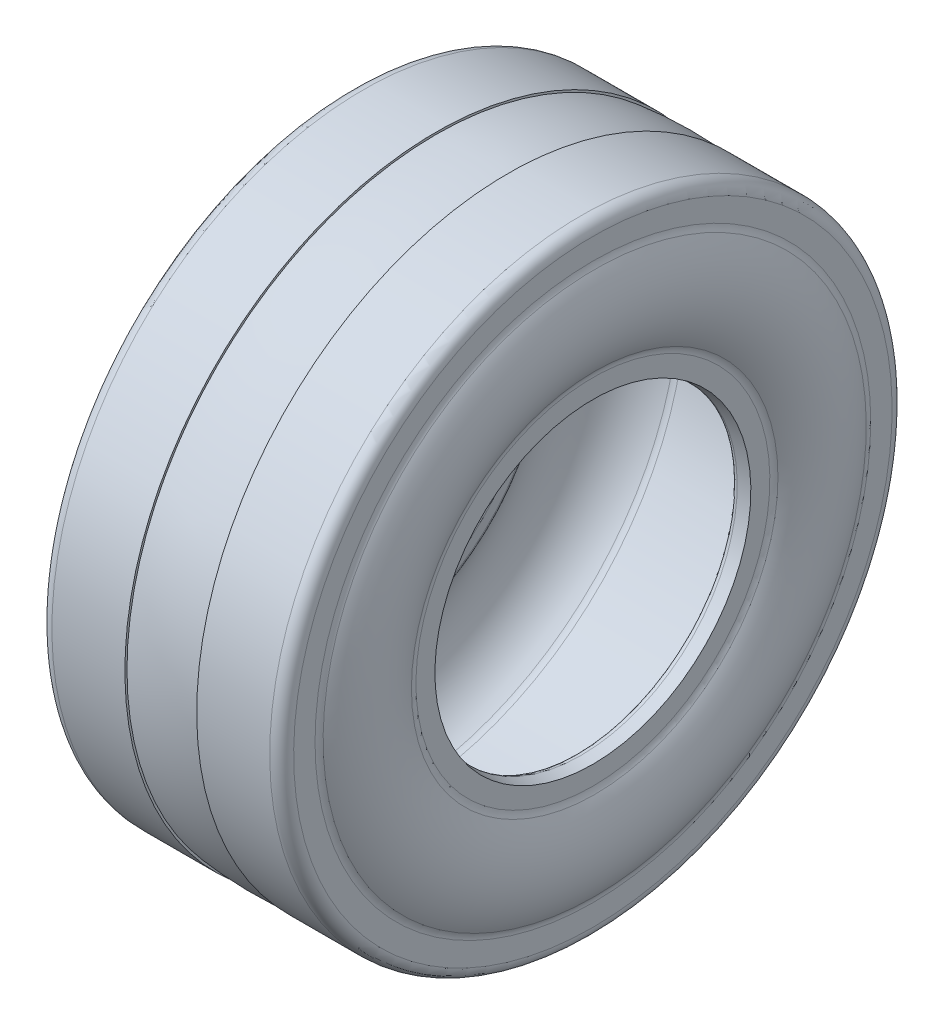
ISO-10303-21;
HEADER;
FILE_DESCRIPTION(('STEP AP214'),'2;1');
FILE_NAME('part.step','',(''),(''),'','','');
FILE_SCHEMA(('AUTOMOTIVE_DESIGN { 1 0 10303 214 1 1 1 1 }'));
ENDSEC;
DATA;
#1=APPLICATION_CONTEXT('core data for automotive mechanical design processes');
#2=APPLICATION_PROTOCOL_DEFINITION('international standard','automotive_design',2000,#1);
#3=PRODUCT_CONTEXT('',#1,'mechanical');
#4=PRODUCT('Part','Part','',(#3));
#5=PRODUCT_RELATED_PRODUCT_CATEGORY('part','',(#4));
#6=PRODUCT_DEFINITION_FORMATION('','',#4);
#7=PRODUCT_DEFINITION_CONTEXT('part definition',#1,'design');
#8=PRODUCT_DEFINITION('design','',#6,#7);
#9=PRODUCT_DEFINITION_SHAPE('','',#8);
#10=(LENGTH_UNIT() NAMED_UNIT(*) SI_UNIT(.MILLI.,.METRE.));
#11=(NAMED_UNIT(*) PLANE_ANGLE_UNIT() SI_UNIT($,.RADIAN.));
#12=(NAMED_UNIT(*) SI_UNIT($,.STERADIAN.) SOLID_ANGLE_UNIT());
#13=UNCERTAINTY_MEASURE_WITH_UNIT(LENGTH_MEASURE(1.E-05),#10,'distance_accuracy_value','');
#14=(GEOMETRIC_REPRESENTATION_CONTEXT(3) GLOBAL_UNCERTAINTY_ASSIGNED_CONTEXT((#13)) GLOBAL_UNIT_ASSIGNED_CONTEXT((#10,
#11,#12)) REPRESENTATION_CONTEXT('',''));
#15=CARTESIAN_POINT('',(0.,0.,0.));
#16=DIRECTION('',(0.,0.,1.));
#17=DIRECTION('',(1.,0.,0.));
#18=AXIS2_PLACEMENT_3D('',#15,#16,#17);
#19=CARTESIAN_POINT('',(2.35414438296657,-163.520702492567,0.));
#20=DIRECTION('',(-1.,0.,0.));
#21=DIRECTION('',(0.,-1.,0.));
#22=AXIS2_PLACEMENT_3D('',#19,#20,#21);
#23=TOROIDAL_SURFACE('',#22,73.9286924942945,4.99999999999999);
#24=CARTESIAN_POINT('',(6.60414438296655,-163.520702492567,0.));
#25=DIRECTION('',(-1.,0.,0.));
#26=DIRECTION('',(0.,-1.,0.));
#27=AXIS2_PLACEMENT_3D('',#24,#25,#26);
#28=CIRCLE('',#27,76.5626059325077);
#29=CARTESIAN_POINT('',(6.60414438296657,-240.083308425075,0.));
#30=VERTEX_POINT('',#29);
#31=EDGE_CURVE('E130',#30,#30,#28,.T.);
#32=ORIENTED_EDGE('',*,*,#31,.T.);
#33=EDGE_LOOP('',(#32));
#34=FACE_BOUND('',#33,.T.);
#35=CARTESIAN_POINT('',(7.35414438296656,-163.520702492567,0.));
#36=DIRECTION('',(-1.,0.,0.));
#37=DIRECTION('',(0.,-1.,0.));
#38=AXIS2_PLACEMENT_3D('',#35,#36,#37);
#39=CIRCLE('',#38,73.9286924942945);
#40=CARTESIAN_POINT('',(7.35414438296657,-237.449394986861,0.));
#41=VERTEX_POINT('',#40);
#42=EDGE_CURVE('E10',#41,#41,#39,.T.);
#43=ORIENTED_EDGE('',*,*,#42,.F.);
#44=EDGE_LOOP('',(#43));
#45=FACE_BOUND('',#44,.T.);
#46=ADVANCED_FACE('F36',(#34,#45),#23,.F.);
#47=CARTESIAN_POINT('',(7.35414438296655,-89.5920099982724,0.));
#48=DIRECTION('',(1.,0.,0.));
#49=DIRECTION('',(0.,1.,0.));
#50=AXIS2_PLACEMENT_3D('',#47,#48,#49);
#51=PLANE('',#50);
#52=CARTESIAN_POINT('',(7.35414438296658,-163.520702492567,0.));
#53=DIRECTION('',(-1.,0.,0.));
#54=DIRECTION('',(0.,-1.,0.));
#55=AXIS2_PLACEMENT_3D('',#52,#53,#54);
#56=CIRCLE('',#55,66.);
#57=CARTESIAN_POINT('',(7.3541443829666,-229.520702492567,0.));
#58=VERTEX_POINT('',#57);
#59=EDGE_CURVE('E42',#58,#58,#56,.T.);
#60=ORIENTED_EDGE('',*,*,#59,.F.);
#61=EDGE_LOOP('',(#60));
#62=FACE_BOUND('',#61,.T.);
#63=ORIENTED_EDGE('',*,*,#42,.T.);
#64=EDGE_LOOP('',(#63));
#65=FACE_BOUND('',#64,.T.);
#66=ADVANCED_FACE('F154',(#62,#65),#51,.F.);
#67=CARTESIAN_POINT('',(7.35414438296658,-163.520702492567,0.));
#68=DIRECTION('',(-1.,0.,0.));
#69=DIRECTION('',(0.,-1.,0.));
#70=AXIS2_PLACEMENT_3D('',#67,#68,#69);
#71=CONICAL_SURFACE('',#70,66.,0.157515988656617);
#72=CARTESIAN_POINT('',(12.2740744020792,-163.520702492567,0.));
#73=DIRECTION('',(-1.,0.,0.));
#74=DIRECTION('',(0.,-1.,0.));
#75=AXIS2_PLACEMENT_3D('',#72,#73,#74);
#76=CIRCLE('',#75,65.2185587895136);
#77=CARTESIAN_POINT('',(12.2740744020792,-228.739261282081,0.));
#78=VERTEX_POINT('',#77);
#79=EDGE_CURVE('E46',#78,#78,#76,.T.);
#80=ORIENTED_EDGE('',*,*,#79,.F.);
#81=EDGE_LOOP('',(#80));
#82=FACE_BOUND('',#81,.T.);
#83=ORIENTED_EDGE('',*,*,#59,.T.);
#84=EDGE_LOOP('',(#83));
#85=FACE_BOUND('',#84,.T.);
#86=ADVANCED_FACE('F158',(#82,#85),#71,.F.);
#87=CARTESIAN_POINT('',(12.587805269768,-163.520702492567,0.));
#88=DIRECTION('',(-1.,0.,0.));
#89=DIRECTION('',(0.,-1.,0.));
#90=AXIS2_PLACEMENT_3D('',#87,#88,#89);
#91=TOROIDAL_SURFACE('',#90,67.1937987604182,2.00000000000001);
#92=ORIENTED_EDGE('',*,*,#79,.T.);
#93=EDGE_LOOP('',(#92));
#94=FACE_BOUND('',#93,.T.);
#95=CARTESIAN_POINT('',(14.5290886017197,-163.520702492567,0.));
#96=DIRECTION('',(-1.,0.,0.));
#97=DIRECTION('',(0.,-1.,0.));
#98=AXIS2_PLACEMENT_3D('',#95,#96,#97);
#99=CIRCLE('',#98,67.6748590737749);
#100=CARTESIAN_POINT('',(14.5290886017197,-231.195561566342,0.));
#101=VERTEX_POINT('',#100);
#102=EDGE_CURVE('E50',#101,#101,#99,.T.);
#103=ORIENTED_EDGE('',*,*,#102,.F.);
#104=EDGE_LOOP('',(#103));
#105=FACE_BOUND('',#104,.T.);
#106=ADVANCED_FACE('F163',(#94,#105),#91,.T.);
#107=CARTESIAN_POINT('',(14.5290886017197,-163.520702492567,0.));
#108=DIRECTION('',(-1.,0.,0.));
#109=DIRECTION('',(0.,-1.,0.));
#110=AXIS2_PLACEMENT_3D('',#107,#108,#109);
#111=CONICAL_SURFACE('',#110,67.6748590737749,1.32788432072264);
#112=CARTESIAN_POINT('',(13.0040116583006,-163.520702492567,0.));
#113=DIRECTION('',(-1.,0.,0.));
#114=DIRECTION('',(0.,-1.,0.));
#115=AXIS2_PLACEMENT_3D('',#112,#113,#114);
#116=CIRCLE('',#115,73.8291943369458);
#117=CARTESIAN_POINT('',(13.0040116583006,-237.349896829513,0.));
#118=VERTEX_POINT('',#117);
#119=EDGE_CURVE('E55',#118,#118,#116,.T.);
#120=ORIENTED_EDGE('',*,*,#119,.F.);
#121=EDGE_LOOP('',(#120));
#122=FACE_BOUND('',#121,.T.);
#123=ORIENTED_EDGE('',*,*,#102,.T.);
#124=EDGE_LOOP('',(#123));
#125=FACE_BOUND('',#124,.T.);
#126=ADVANCED_FACE('F169',(#122,#125),#111,.T.);
#127=CARTESIAN_POINT('',(8.15080332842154,-163.520702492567,0.));
#128=DIRECTION('',(-1.,0.,0.));
#129=DIRECTION('',(0.,-1.,0.));
#130=AXIS2_PLACEMENT_3D('',#127,#128,#129);
#131=TOROIDAL_SURFACE('',#130,72.626543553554,5.00000000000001);
#132=ORIENTED_EDGE('',*,*,#119,.T.);
#133=EDGE_LOOP('',(#132));
#134=FACE_BOUND('',#133,.T.);
#135=CARTESIAN_POINT('',(12.0679340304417,-163.520702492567,0.));
#136=DIRECTION('',(-1.,0.,0.));
#137=DIRECTION('',(0.,-1.,0.));
#138=AXIS2_PLACEMENT_3D('',#135,#136,#137);
#139=CIRCLE('',#138,75.7339680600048);
#140=CARTESIAN_POINT('',(12.0679340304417,-239.254670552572,0.));
#141=VERTEX_POINT('',#140);
#142=EDGE_CURVE('E58',#141,#141,#139,.T.);
#143=ORIENTED_EDGE('',*,*,#142,.F.);
#144=EDGE_LOOP('',(#143));
#145=FACE_BOUND('',#144,.T.);
#146=ADVANCED_FACE('F173',(#134,#145),#131,.T.);
#147=CARTESIAN_POINT('',(36.3541443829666,-163.520702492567,0.));
#148=DIRECTION('',(-1.,0.,0.));
#149=DIRECTION('',(0.,-1.,0.));
#150=AXIS2_PLACEMENT_3D('',#147,#148,#149);
#151=TOROIDAL_SURFACE('',#150,95.,31.);
#152=ORIENTED_EDGE('',*,*,#142,.T.);
#153=EDGE_LOOP('',(#152));
#154=FACE_BOUND('',#153,.T.);
#155=CARTESIAN_POINT('',(21.8981818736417,-163.520702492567,0.));
#156=DIRECTION('',(-1.,0.,0.));
#157=DIRECTION('',(0.,-1.,0.));
#158=AXIS2_PLACEMENT_3D('',#155,#156,#157);
#159=CIRCLE('',#158,122.423076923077);
#160=CARTESIAN_POINT('',(21.8981818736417,-285.943779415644,0.));
#161=VERTEX_POINT('',#160);
#162=EDGE_CURVE('E61',#161,#161,#159,.T.);
#163=ORIENTED_EDGE('',*,*,#162,.F.);
#164=EDGE_LOOP('',(#163));
#165=FACE_BOUND('',#164,.T.);
#166=ADVANCED_FACE('F177',(#154,#165),#151,.F.);
#167=CARTESIAN_POINT('',(24.2297887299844,-163.520702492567,0.));
#168=DIRECTION('',(-1.,0.,0.));
#169=DIRECTION('',(0.,-1.,0.));
#170=AXIS2_PLACEMENT_3D('',#167,#168,#169);
#171=TOROIDAL_SURFACE('',#170,118.,4.99999999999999);
#172=ORIENTED_EDGE('',*,*,#162,.T.);
#173=EDGE_LOOP('',(#172));
#174=FACE_BOUND('',#173,.T.);
#175=CARTESIAN_POINT('',(24.2297887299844,-163.520702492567,0.));
#176=DIRECTION('',(-1.,0.,0.));
#177=DIRECTION('',(0.,-1.,0.));
#178=AXIS2_PLACEMENT_3D('',#175,#176,#177);
#179=CIRCLE('',#178,123.);
#180=CARTESIAN_POINT('',(24.2297887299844,-286.520702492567,0.));
#181=VERTEX_POINT('',#180);
#182=EDGE_CURVE('E64',#181,#181,#179,.T.);
#183=ORIENTED_EDGE('',*,*,#182,.F.);
#184=EDGE_LOOP('',(#183));
#185=FACE_BOUND('',#184,.T.);
#186=ADVANCED_FACE('F181',(#174,#185),#171,.F.);
#187=CARTESIAN_POINT('',(0.,-163.520702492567,0.));
#188=DIRECTION('',(-1.,0.,0.));
#189=DIRECTION('',(0.,-1.,0.));
#190=AXIS2_PLACEMENT_3D('',#187,#188,#189);
#191=CYLINDRICAL_SURFACE('',#190,123.);
#192=CARTESIAN_POINT('',(91.4785000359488,-163.520702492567,0.));
#193=DIRECTION('',(-1.,0.,0.));
#194=DIRECTION('',(0.,-1.,0.));
#195=AXIS2_PLACEMENT_3D('',#192,#193,#194);
#196=CIRCLE('',#195,123.);
#197=CARTESIAN_POINT('',(91.4785000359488,-286.520702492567,0.));
#198=VERTEX_POINT('',#197);
#199=EDGE_CURVE('E67',#198,#198,#196,.T.);
#200=ORIENTED_EDGE('',*,*,#199,.F.);
#201=EDGE_LOOP('',(#200));
#202=FACE_BOUND('',#201,.T.);
#203=ORIENTED_EDGE('',*,*,#182,.T.);
#204=EDGE_LOOP('',(#203));
#205=FACE_BOUND('',#204,.T.);
#206=ADVANCED_FACE('F185',(#202,#205),#191,.F.);
#207=CARTESIAN_POINT('',(91.4785000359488,-163.520702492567,0.));
#208=DIRECTION('',(-1.,0.,0.));
#209=DIRECTION('',(0.,-1.,0.));
#210=AXIS2_PLACEMENT_3D('',#207,#208,#209);
#211=TOROIDAL_SURFACE('',#210,118.,5.);
#212=CARTESIAN_POINT('',(93.8101068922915,-163.520702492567,0.));
#213=DIRECTION('',(-1.,0.,0.));
#214=DIRECTION('',(0.,-1.,0.));
#215=AXIS2_PLACEMENT_3D('',#212,#213,#214);
#216=CIRCLE('',#215,122.423076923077);
#217=CARTESIAN_POINT('',(93.8101068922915,-285.943779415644,0.));
#218=VERTEX_POINT('',#217);
#219=EDGE_CURVE('E70',#218,#218,#216,.T.);
#220=ORIENTED_EDGE('',*,*,#219,.F.);
#221=EDGE_LOOP('',(#220));
#222=FACE_BOUND('',#221,.T.);
#223=ORIENTED_EDGE('',*,*,#199,.T.);
#224=EDGE_LOOP('',(#223));
#225=FACE_BOUND('',#224,.T.);
#226=ADVANCED_FACE('F189',(#222,#225),#211,.F.);
#227=CARTESIAN_POINT('',(79.3541443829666,-163.520702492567,0.));
#228=DIRECTION('',(-1.,0.,0.));
#229=DIRECTION('',(0.,-1.,0.));
#230=AXIS2_PLACEMENT_3D('',#227,#228,#229);
#231=TOROIDAL_SURFACE('',#230,95.,31.);
#232=CARTESIAN_POINT('',(103.640354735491,-163.520702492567,0.));
#233=DIRECTION('',(-1.,0.,0.));
#234=DIRECTION('',(0.,-1.,0.));
#235=AXIS2_PLACEMENT_3D('',#232,#233,#234);
#236=CIRCLE('',#235,75.7339680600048);
#237=CARTESIAN_POINT('',(103.640354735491,-239.254670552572,0.));
#238=VERTEX_POINT('',#237);
#239=EDGE_CURVE('E73',#238,#238,#236,.T.);
#240=ORIENTED_EDGE('',*,*,#239,.F.);
#241=EDGE_LOOP('',(#240));
#242=FACE_BOUND('',#241,.T.);
#243=ORIENTED_EDGE('',*,*,#219,.T.);
#244=EDGE_LOOP('',(#243));
#245=FACE_BOUND('',#244,.T.);
#246=ADVANCED_FACE('F193',(#242,#245),#231,.F.);
#247=CARTESIAN_POINT('',(107.557485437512,-163.520702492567,0.));
#248=DIRECTION('',(-1.,0.,0.));
#249=DIRECTION('',(0.,-1.,0.));
#250=AXIS2_PLACEMENT_3D('',#247,#248,#249);
#251=TOROIDAL_SURFACE('',#250,72.626543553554,5.00000000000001);
#252=CARTESIAN_POINT('',(102.704277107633,-163.520702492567,0.));
#253=DIRECTION('',(-1.,0.,0.));
#254=DIRECTION('',(0.,-1.,0.));
#255=AXIS2_PLACEMENT_3D('',#252,#253,#254);
#256=CIRCLE('',#255,73.8291943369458);
#257=CARTESIAN_POINT('',(102.704277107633,-237.349896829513,0.));
#258=VERTEX_POINT('',#257);
#259=EDGE_CURVE('E76',#258,#258,#256,.T.);
#260=ORIENTED_EDGE('',*,*,#259,.F.);
#261=EDGE_LOOP('',(#260));
#262=FACE_BOUND('',#261,.T.);
#263=ORIENTED_EDGE('',*,*,#239,.T.);
#264=EDGE_LOOP('',(#263));
#265=FACE_BOUND('',#264,.T.);
#266=ADVANCED_FACE('F197',(#262,#265),#251,.T.);
#267=CARTESIAN_POINT('',(101.179200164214,-163.520702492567,0.));
#268=DIRECTION('',(1.,0.,0.));
#269=DIRECTION('',(0.,1.,0.));
#270=AXIS2_PLACEMENT_3D('',#267,#268,#269);
#271=CONICAL_SURFACE('',#270,67.6748590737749,1.32788432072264);
#272=ORIENTED_EDGE('',*,*,#259,.T.);
#273=EDGE_LOOP('',(#272));
#274=FACE_BOUND('',#273,.T.);
#275=CARTESIAN_POINT('',(101.179200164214,-163.520702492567,0.));
#276=DIRECTION('',(-1.,0.,0.));
#277=DIRECTION('',(0.,-1.,0.));
#278=AXIS2_PLACEMENT_3D('',#275,#276,#277);
#279=CIRCLE('',#278,67.6748590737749);
#280=CARTESIAN_POINT('',(101.179200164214,-231.195561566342,0.));
#281=VERTEX_POINT('',#280);
#282=EDGE_CURVE('E79',#281,#281,#279,.T.);
#283=ORIENTED_EDGE('',*,*,#282,.F.);
#284=EDGE_LOOP('',(#283));
#285=FACE_BOUND('',#284,.T.);
#286=ADVANCED_FACE('F201',(#274,#285),#271,.T.);
#287=CARTESIAN_POINT('',(103.120483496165,-163.520702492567,0.));
#288=DIRECTION('',(-1.,0.,0.));
#289=DIRECTION('',(0.,-1.,0.));
#290=AXIS2_PLACEMENT_3D('',#287,#288,#289);
#291=TOROIDAL_SURFACE('',#290,67.1937987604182,2.00000000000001);
#292=CARTESIAN_POINT('',(103.434214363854,-163.520702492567,0.));
#293=DIRECTION('',(-1.,0.,0.));
#294=DIRECTION('',(0.,-1.,0.));
#295=AXIS2_PLACEMENT_3D('',#292,#293,#294);
#296=CIRCLE('',#295,65.2185587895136);
#297=CARTESIAN_POINT('',(103.434214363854,-228.73926128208,0.));
#298=VERTEX_POINT('',#297);
#299=EDGE_CURVE('E82',#298,#298,#296,.T.);
#300=ORIENTED_EDGE('',*,*,#299,.F.);
#301=EDGE_LOOP('',(#300));
#302=FACE_BOUND('',#301,.T.);
#303=ORIENTED_EDGE('',*,*,#282,.T.);
#304=EDGE_LOOP('',(#303));
#305=FACE_BOUND('',#304,.T.);
#306=ADVANCED_FACE('F205',(#302,#305),#291,.T.);
#307=CARTESIAN_POINT('',(108.354144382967,-163.520702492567,0.));
#308=DIRECTION('',(1.,0.,0.));
#309=DIRECTION('',(0.,1.,0.));
#310=AXIS2_PLACEMENT_3D('',#307,#308,#309);
#311=CONICAL_SURFACE('',#310,66.,0.157515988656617);
#312=ORIENTED_EDGE('',*,*,#299,.T.);
#313=EDGE_LOOP('',(#312));
#314=FACE_BOUND('',#313,.T.);
#315=CARTESIAN_POINT('',(108.354144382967,-163.520702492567,0.));
#316=DIRECTION('',(-1.,0.,0.));
#317=DIRECTION('',(0.,-1.,0.));
#318=AXIS2_PLACEMENT_3D('',#315,#316,#317);
#319=CIRCLE('',#318,66.);
#320=CARTESIAN_POINT('',(108.354144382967,-229.520702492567,0.));
#321=VERTEX_POINT('',#320);
#322=EDGE_CURVE('E85',#321,#321,#319,.T.);
#323=ORIENTED_EDGE('',*,*,#322,.F.);
#324=EDGE_LOOP('',(#323));
#325=FACE_BOUND('',#324,.T.);
#326=ADVANCED_FACE('F209',(#314,#325),#311,.F.);
#327=CARTESIAN_POINT('',(108.354144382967,-89.5920099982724,0.));
#328=DIRECTION('',(1.,0.,0.));
#329=DIRECTION('',(0.,1.,0.));
#330=AXIS2_PLACEMENT_3D('',#327,#328,#329);
#331=PLANE('',#330);
#332=ORIENTED_EDGE('',*,*,#322,.T.);
#333=EDGE_LOOP('',(#332));
#334=FACE_BOUND('',#333,.T.);
#335=CARTESIAN_POINT('',(108.354144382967,-163.520702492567,0.));
#336=DIRECTION('',(-1.,0.,0.));
#337=DIRECTION('',(0.,-1.,0.));
#338=AXIS2_PLACEMENT_3D('',#335,#336,#337);
#339=CIRCLE('',#338,73.9286924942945);
#340=CARTESIAN_POINT('',(108.354144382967,-237.449394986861,0.));
#341=VERTEX_POINT('',#340);
#342=EDGE_CURVE('E88',#341,#341,#339,.T.);
#343=ORIENTED_EDGE('',*,*,#342,.F.);
#344=EDGE_LOOP('',(#343));
#345=FACE_BOUND('',#344,.T.);
#346=ADVANCED_FACE('F213',(#334,#345),#331,.T.);
#347=CARTESIAN_POINT('',(113.354144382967,-163.520702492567,0.));
#348=DIRECTION('',(-1.,0.,0.));
#349=DIRECTION('',(0.,-1.,0.));
#350=AXIS2_PLACEMENT_3D('',#347,#348,#349);
#351=TOROIDAL_SURFACE('',#350,73.9286924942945,4.99999999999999);
#352=CARTESIAN_POINT('',(109.104144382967,-163.520702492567,0.));
#353=DIRECTION('',(-1.,0.,0.));
#354=DIRECTION('',(0.,-1.,0.));
#355=AXIS2_PLACEMENT_3D('',#352,#353,#354);
#356=CIRCLE('',#355,76.5626059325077);
#357=CARTESIAN_POINT('',(109.104144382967,-240.083308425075,0.));
#358=VERTEX_POINT('',#357);
#359=EDGE_CURVE('E91',#358,#358,#356,.T.);
#360=ORIENTED_EDGE('',*,*,#359,.F.);
#361=EDGE_LOOP('',(#360));
#362=FACE_BOUND('',#361,.T.);
#363=ORIENTED_EDGE('',*,*,#342,.T.);
#364=EDGE_LOOP('',(#363));
#365=FACE_BOUND('',#364,.T.);
#366=ADVANCED_FACE('F217',(#362,#365),#351,.F.);
#367=CARTESIAN_POINT('',(79.3541443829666,-163.520702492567,0.));
#368=DIRECTION('',(-1.,0.,0.));
#369=DIRECTION('',(0.,-1.,0.));
#370=AXIS2_PLACEMENT_3D('',#367,#368,#369);
#371=TOROIDAL_SURFACE('',#370,95.,35.);
#372=ORIENTED_EDGE('',*,*,#359,.T.);
#373=EDGE_LOOP('',(#372));
#374=FACE_BOUND('',#373,.T.);
#375=CARTESIAN_POINT('',(109.104144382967,-163.520702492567,0.));
#376=DIRECTION('',(-1.,0.,0.));
#377=DIRECTION('',(0.,-1.,0.));
#378=AXIS2_PLACEMENT_3D('',#375,#376,#377);
#379=CIRCLE('',#378,113.437394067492);
#380=CARTESIAN_POINT('',(109.104144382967,-276.958096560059,0.));
#381=VERTEX_POINT('',#380);
#382=EDGE_CURVE('E94',#381,#381,#379,.T.);
#383=ORIENTED_EDGE('',*,*,#382,.F.);
#384=EDGE_LOOP('',(#383));
#385=FACE_BOUND('',#384,.T.);
#386=ADVANCED_FACE('F221',(#374,#385),#371,.T.);
#387=CARTESIAN_POINT('',(113.354144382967,-163.520702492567,0.));
#388=DIRECTION('',(-1.,0.,0.));
#389=DIRECTION('',(0.,-1.,0.));
#390=AXIS2_PLACEMENT_3D('',#387,#388,#389);
#391=TOROIDAL_SURFACE('',#390,116.071307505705,5.);
#392=CARTESIAN_POINT('',(108.354144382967,-163.520702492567,0.));
#393=DIRECTION('',(-1.,0.,0.));
#394=DIRECTION('',(0.,-1.,0.));
#395=AXIS2_PLACEMENT_3D('',#392,#393,#394);
#396=CIRCLE('',#395,116.071307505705);
#397=CARTESIAN_POINT('',(108.354144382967,-279.592009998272,0.));
#398=VERTEX_POINT('',#397);
#399=EDGE_CURVE('E97',#398,#398,#396,.T.);
#400=ORIENTED_EDGE('',*,*,#399,.F.);
#401=EDGE_LOOP('',(#400));
#402=FACE_BOUND('',#401,.T.);
#403=ORIENTED_EDGE('',*,*,#382,.T.);
#404=EDGE_LOOP('',(#403));
#405=FACE_BOUND('',#404,.T.);
#406=ADVANCED_FACE('F225',(#402,#405),#391,.F.);
#407=CARTESIAN_POINT('',(108.354144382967,-38.5207024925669,0.));
#408=DIRECTION('',(1.,0.,0.));
#409=DIRECTION('',(0.,1.,0.));
#410=AXIS2_PLACEMENT_3D('',#407,#408,#409);
#411=PLANE('',#410);
#412=ORIENTED_EDGE('',*,*,#399,.T.);
#413=EDGE_LOOP('',(#412));
#414=FACE_BOUND('',#413,.T.);
#415=CARTESIAN_POINT('',(108.354144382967,-163.520702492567,0.));
#416=DIRECTION('',(-1.,0.,0.));
#417=DIRECTION('',(0.,-1.,0.));
#418=AXIS2_PLACEMENT_3D('',#415,#416,#417);
#419=CIRCLE('',#418,125.);
#420=CARTESIAN_POINT('',(108.354144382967,-288.520702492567,0.));
#421=VERTEX_POINT('',#420);
#422=EDGE_CURVE('E100',#421,#421,#419,.T.);
#423=ORIENTED_EDGE('',*,*,#422,.F.);
#424=EDGE_LOOP('',(#423));
#425=FACE_BOUND('',#424,.T.);
#426=ADVANCED_FACE('F229',(#414,#425),#411,.T.);
#427=CARTESIAN_POINT('',(103.354144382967,-163.520702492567,0.));
#428=DIRECTION('',(-1.,0.,0.));
#429=DIRECTION('',(0.,-1.,0.));
#430=AXIS2_PLACEMENT_3D('',#427,#428,#429);
#431=TOROIDAL_SURFACE('',#430,125.,5.);
#432=ORIENTED_EDGE('',*,*,#422,.T.);
#433=EDGE_LOOP('',(#432));
#434=FACE_BOUND('',#433,.T.);
#435=CARTESIAN_POINT('',(103.354144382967,-163.520702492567,0.));
#436=DIRECTION('',(-1.,0.,0.));
#437=DIRECTION('',(0.,-1.,0.));
#438=AXIS2_PLACEMENT_3D('',#435,#436,#437);
#439=CIRCLE('',#438,130.);
#440=CARTESIAN_POINT('',(103.354144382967,-293.520702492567,0.));
#441=VERTEX_POINT('',#440);
#442=EDGE_CURVE('E103',#441,#441,#439,.T.);
#443=ORIENTED_EDGE('',*,*,#442,.F.);
#444=EDGE_LOOP('',(#443));
#445=FACE_BOUND('',#444,.T.);
#446=ADVANCED_FACE('F233',(#434,#445),#431,.T.);
#447=CARTESIAN_POINT('',(0.,-163.520702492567,0.));
#448=DIRECTION('',(-1.,0.,0.));
#449=DIRECTION('',(0.,-1.,0.));
#450=AXIS2_PLACEMENT_3D('',#447,#448,#449);
#451=CYLINDRICAL_SURFACE('',#450,130.);
#452=ORIENTED_EDGE('',*,*,#442,.T.);
#453=EDGE_LOOP('',(#452));
#454=FACE_BOUND('',#453,.T.);
#455=CARTESIAN_POINT('',(72.8541443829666,-163.520702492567,0.));
#456=DIRECTION('',(-1.,0.,0.));
#457=DIRECTION('',(0.,-1.,0.));
#458=AXIS2_PLACEMENT_3D('',#455,#456,#457);
#459=CIRCLE('',#458,130.);
#460=CARTESIAN_POINT('',(72.8541443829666,-293.520702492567,0.));
#461=VERTEX_POINT('',#460);
#462=EDGE_CURVE('E106',#461,#461,#459,.T.);
#463=ORIENTED_EDGE('',*,*,#462,.F.);
#464=EDGE_LOOP('',(#463));
#465=FACE_BOUND('',#464,.T.);
#466=ADVANCED_FACE('F237',(#454,#465),#451,.T.);
#467=CARTESIAN_POINT('',(72.8541443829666,-33.5207024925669,0.));
#468=DIRECTION('',(1.,0.,0.));
#469=DIRECTION('',(0.,1.,0.));
#470=AXIS2_PLACEMENT_3D('',#467,#468,#469);
#471=PLANE('',#470);
#472=CARTESIAN_POINT('',(72.8541443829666,-163.520702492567,0.));
#473=DIRECTION('',(-1.,0.,0.));
#474=DIRECTION('',(0.,-1.,0.));
#475=AXIS2_PLACEMENT_3D('',#472,#473,#474);
#476=CIRCLE('',#475,129.13171570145);
#477=CARTESIAN_POINT('',(72.8541443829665,-34.3889867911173,0.));
#478=VERTEX_POINT('',#477);
#479=EDGE_CURVE('E109',#478,#478,#476,.T.);
#480=ORIENTED_EDGE('',*,*,#479,.F.);
#481=EDGE_LOOP('',(#480));
#482=FACE_BOUND('',#481,.T.);
#483=ORIENTED_EDGE('',*,*,#462,.T.);
#484=EDGE_LOOP('',(#483));
#485=FACE_BOUND('',#484,.T.);
#486=ADVANCED_FACE('F241',(#482,#485),#471,.F.);
#487=CARTESIAN_POINT('',(57.8541443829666,-163.520702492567,0.));
#488=DIRECTION('',(-1.,0.,0.));
#489=DIRECTION('',(0.,1.,0.));
#490=AXIS2_PLACEMENT_3D('',#487,#488,#489);
#491=SPHERICAL_SURFACE('',#490,130.);
#492=CARTESIAN_POINT('',(42.8541443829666,-163.520702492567,0.));
#493=DIRECTION('',(-1.,0.,0.));
#494=DIRECTION('',(0.,-1.,0.));
#495=AXIS2_PLACEMENT_3D('',#492,#493,#494);
#496=CIRCLE('',#495,129.13171570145);
#497=CARTESIAN_POINT('',(42.8541443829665,-34.3889867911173,0.));
#498=VERTEX_POINT('',#497);
#499=EDGE_CURVE('E112',#498,#498,#496,.T.);
#500=CARTESIAN_POINT('',(42.8541443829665,-34.3889867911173,0.));
#501=CARTESIAN_POINT('',(43.1652501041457,-34.3528485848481,0.));
#502=CARTESIAN_POINT('',(43.4764864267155,-34.317834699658,0.));
#503=CARTESIAN_POINT('',(44.0992040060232,-34.2500573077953,0.));
#504=CARTESIAN_POINT('',(44.4106852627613,-34.2172938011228,0.));
#505=CARTESIAN_POINT('',(45.0338764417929,-34.1540189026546,0.));
#506=CARTESIAN_POINT('',(45.3455863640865,-34.123507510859,0.));
#507=CARTESIAN_POINT('',(45.969218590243,-34.0647384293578,0.));
#508=CARTESIAN_POINT('',(46.2811408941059,-34.0364807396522,0.));
#509=CARTESIAN_POINT('',(46.9051815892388,-33.9822205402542,0.));
#510=CARTESIAN_POINT('',(47.2172999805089,-33.9562180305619,0.));
#511=CARTESIAN_POINT('',(47.8417165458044,-33.9064695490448,0.));
#512=CARTESIAN_POINT('',(48.1540147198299,-33.8827235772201,0.));
#513=CARTESIAN_POINT('',(48.7787745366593,-33.8374894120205,0.));
#514=CARTESIAN_POINT('',(49.0912361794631,-33.8160012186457,0.));
#515=CARTESIAN_POINT('',(49.7163066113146,-33.7752837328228,0.));
#516=CARTESIAN_POINT('',(50.0289154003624,-33.7560544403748,0.));
#517=CARTESIAN_POINT('',(50.6542637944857,-33.7198557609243,0.));
#518=CARTESIAN_POINT('',(50.9670033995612,-33.7028863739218,0.));
#519=CARTESIAN_POINT('',(51.5925970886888,-33.6712083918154,0.));
#520=CARTESIAN_POINT('',(51.905451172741,-33.6564997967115,0.));
#521=CARTESIAN_POINT('',(52.5312574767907,-33.629344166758,0.));
#522=CARTESIAN_POINT('',(52.8442096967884,-33.6168971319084,0.));
#523=CARTESIAN_POINT('',(53.4701959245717,-33.5942652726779,0.));
#524=CARTESIAN_POINT('',(53.7832299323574,-33.584080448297,0.));
#525=CARTESIAN_POINT('',(54.4093633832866,-33.565973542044,0.));
#526=CARTESIAN_POINT('',(54.7224628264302,-33.558051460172,0.));
#527=CARTESIAN_POINT('',(55.3487107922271,-33.5444704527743,0.));
#528=CARTESIAN_POINT('',(55.6618593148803,-33.5388115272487,0.));
#529=CARTESIAN_POINT('',(56.2881890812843,-33.529757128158,0.));
#530=CARTESIAN_POINT('',(56.6013703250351,-33.5263616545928,0.));
#531=CARTESIAN_POINT('',(57.2277491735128,-33.5218343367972,0.));
#532=CARTESIAN_POINT('',(57.5409467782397,-33.5207024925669,0.));
#533=CARTESIAN_POINT('',(58.1673419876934,-33.5207024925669,0.));
#534=CARTESIAN_POINT('',(58.4805395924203,-33.5218343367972,0.));
#535=CARTESIAN_POINT('',(59.106918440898,-33.5263616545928,0.));
#536=CARTESIAN_POINT('',(59.4200996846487,-33.529757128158,0.));
#537=CARTESIAN_POINT('',(60.0464294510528,-33.5388115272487,0.));
#538=CARTESIAN_POINT('',(60.359577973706,-33.5444704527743,0.));
#539=CARTESIAN_POINT('',(60.9858259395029,-33.558051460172,0.));
#540=CARTESIAN_POINT('',(61.2989253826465,-33.565973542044,0.));
#541=CARTESIAN_POINT('',(61.9250588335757,-33.584080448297,0.));
#542=CARTESIAN_POINT('',(62.2380928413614,-33.5942652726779,0.));
#543=CARTESIAN_POINT('',(62.8640790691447,-33.6168971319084,0.));
#544=CARTESIAN_POINT('',(63.1770312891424,-33.629344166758,0.));
#545=CARTESIAN_POINT('',(63.8028375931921,-33.6564997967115,0.));
#546=CARTESIAN_POINT('',(64.1156916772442,-33.6712083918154,0.));
#547=CARTESIAN_POINT('',(64.7412853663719,-33.7028863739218,0.));
#548=CARTESIAN_POINT('',(65.0540249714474,-33.7198557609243,0.));
#549=CARTESIAN_POINT('',(65.6793733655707,-33.7560544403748,0.));
#550=CARTESIAN_POINT('',(65.9919821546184,-33.7752837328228,0.));
#551=CARTESIAN_POINT('',(66.61705258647,-33.8160012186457,0.));
#552=CARTESIAN_POINT('',(66.9295142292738,-33.8374894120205,0.));
#553=CARTESIAN_POINT('',(67.5542740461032,-33.8827235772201,0.));
#554=CARTESIAN_POINT('',(67.8665722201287,-33.9064695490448,0.));
#555=CARTESIAN_POINT('',(68.4909887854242,-33.9562180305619,0.));
#556=CARTESIAN_POINT('',(68.8031071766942,-33.9822205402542,0.));
#557=CARTESIAN_POINT('',(69.4271478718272,-34.0364807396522,0.));
#558=CARTESIAN_POINT('',(69.7390701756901,-34.0647384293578,0.));
#559=CARTESIAN_POINT('',(70.3627024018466,-34.123507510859,0.));
#560=CARTESIAN_POINT('',(70.6744123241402,-34.1540189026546,0.));
#561=CARTESIAN_POINT('',(71.2976035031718,-34.2172938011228,0.));
#562=CARTESIAN_POINT('',(71.6090847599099,-34.2500573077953,0.));
#563=CARTESIAN_POINT('',(72.2318023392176,-34.317834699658,0.));
#564=CARTESIAN_POINT('',(72.5430386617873,-34.3528485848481,0.));
#565=CARTESIAN_POINT('',(72.8541443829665,-34.3889867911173,0.));
#566=B_SPLINE_CURVE_WITH_KNOTS('',3,(#500,#501,#502,#503,#504,#505,#506,#507,#508,#509,#510,
#511,#512,#513,#514,#515,#516,#517,#518,#519,#520,#521,#522,#523,#524,#525,#526,#527,#528,#529,
#530,#531,#532,#533,#534,#535,#536,#537,#538,#539,#540,#541,#542,#543,#544,#545,#546,#547,#548,
#549,#550,#551,#552,#553,#554,#555,#556,#557,#558,#559,#560,#561,#562,#563,#564,#565),
.UNSPECIFIED.,.F.,.F.,(4,2,2,2,2,2,2,2,2,2,2,2,2,2,2,2,2,2,2,2,2,2,2,2,2,2,2,2,2,2,2,2,4),(0.,
0.939590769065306,1.87918153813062,2.81877230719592,3.75836307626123,4.69795384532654,
5.63754461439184,6.57713538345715,7.51672615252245,8.45631692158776,9.39590769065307,
10.3354984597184,11.2750892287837,12.214679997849,13.1542707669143,14.0938615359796,
15.0334523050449,15.9730430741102,16.9126338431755,17.8522246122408,18.7918153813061,
19.7314061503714,20.6709969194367,21.610587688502,22.5501784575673,23.4897692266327,
24.429359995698,25.3689507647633,26.3085415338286,27.2481323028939,28.1877230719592,
29.1273138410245,30.0669046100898),.UNSPECIFIED.);
#567=EDGE_CURVE('BSEAM245',#498,#478,#566,.T.);
#568=ORIENTED_EDGE('',*,*,#499,.F.);
#569=ORIENTED_EDGE('',*,*,#479,.T.);
#570=ORIENTED_EDGE('',*,*,#567,.T.);
#571=ORIENTED_EDGE('',*,*,#567,.F.);
#572=EDGE_LOOP('',(#568,#570,#569,#571));
#573=FACE_BOUND('',#572,.T.);
#574=ADVANCED_FACE('F245',(#573),#491,.T.);
#575=CARTESIAN_POINT('',(42.8541443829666,-33.5207024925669,0.));
#576=DIRECTION('',(1.,0.,0.));
#577=DIRECTION('',(0.,1.,0.));
#578=AXIS2_PLACEMENT_3D('',#575,#576,#577);
#579=PLANE('',#578);
#580=ORIENTED_EDGE('',*,*,#499,.T.);
#581=EDGE_LOOP('',(#580));
#582=FACE_BOUND('',#581,.T.);
#583=CARTESIAN_POINT('',(42.8541443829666,-163.520702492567,0.));
#584=DIRECTION('',(-1.,0.,0.));
#585=DIRECTION('',(0.,-1.,0.));
#586=AXIS2_PLACEMENT_3D('',#583,#584,#585);
#587=CIRCLE('',#586,130.);
#588=CARTESIAN_POINT('',(42.8541443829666,-293.520702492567,0.));
#589=VERTEX_POINT('',#588);
#590=EDGE_CURVE('E115',#589,#589,#587,.T.);
#591=ORIENTED_EDGE('',*,*,#590,.F.);
#592=EDGE_LOOP('',(#591));
#593=FACE_BOUND('',#592,.T.);
#594=ADVANCED_FACE('F249',(#582,#593),#579,.T.);
#595=CARTESIAN_POINT('',(0.,-163.520702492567,0.));
#596=DIRECTION('',(-1.,0.,0.));
#597=DIRECTION('',(0.,-1.,0.));
#598=AXIS2_PLACEMENT_3D('',#595,#596,#597);
#599=CYLINDRICAL_SURFACE('',#598,130.);
#600=ORIENTED_EDGE('',*,*,#590,.T.);
#601=EDGE_LOOP('',(#600));
#602=FACE_BOUND('',#601,.T.);
#603=CARTESIAN_POINT('',(12.3541443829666,-163.520702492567,0.));
#604=DIRECTION('',(-1.,0.,0.));
#605=DIRECTION('',(0.,-1.,0.));
#606=AXIS2_PLACEMENT_3D('',#603,#604,#605);
#607=CIRCLE('',#606,130.);
#608=CARTESIAN_POINT('',(12.3541443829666,-293.520702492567,0.));
#609=VERTEX_POINT('',#608);
#610=EDGE_CURVE('E118',#609,#609,#607,.T.);
#611=ORIENTED_EDGE('',*,*,#610,.F.);
#612=EDGE_LOOP('',(#611));
#613=FACE_BOUND('',#612,.T.);
#614=ADVANCED_FACE('F253',(#602,#613),#599,.T.);
#615=CARTESIAN_POINT('',(12.3541443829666,-163.520702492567,0.));
#616=DIRECTION('',(-1.,0.,0.));
#617=DIRECTION('',(0.,-1.,0.));
#618=AXIS2_PLACEMENT_3D('',#615,#616,#617);
#619=TOROIDAL_SURFACE('',#618,125.,5.);
#620=CARTESIAN_POINT('',(7.35414438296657,-163.520702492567,0.));
#621=DIRECTION('',(-1.,0.,0.));
#622=DIRECTION('',(0.,-1.,0.));
#623=AXIS2_PLACEMENT_3D('',#620,#621,#622);
#624=CIRCLE('',#623,125.);
#625=CARTESIAN_POINT('',(7.3541443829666,-288.520702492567,0.));
#626=VERTEX_POINT('',#625);
#627=EDGE_CURVE('E121',#626,#626,#624,.T.);
#628=ORIENTED_EDGE('',*,*,#627,.F.);
#629=EDGE_LOOP('',(#628));
#630=FACE_BOUND('',#629,.T.);
#631=ORIENTED_EDGE('',*,*,#610,.T.);
#632=EDGE_LOOP('',(#631));
#633=FACE_BOUND('',#632,.T.);
#634=ADVANCED_FACE('F150',(#630,#633),#619,.T.);
#635=CARTESIAN_POINT('',(7.35414438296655,-38.5207024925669,0.));
#636=DIRECTION('',(1.,0.,0.));
#637=DIRECTION('',(0.,1.,0.));
#638=AXIS2_PLACEMENT_3D('',#635,#636,#637);
#639=PLANE('',#638);
#640=CARTESIAN_POINT('',(7.35414438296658,-163.520702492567,0.));
#641=DIRECTION('',(-1.,0.,0.));
#642=DIRECTION('',(0.,-1.,0.));
#643=AXIS2_PLACEMENT_3D('',#640,#641,#642);
#644=CIRCLE('',#643,116.071307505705);
#645=CARTESIAN_POINT('',(7.35414438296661,-279.592009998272,0.));
#646=VERTEX_POINT('',#645);
#647=EDGE_CURVE('E124',#646,#646,#644,.T.);
#648=ORIENTED_EDGE('',*,*,#647,.F.);
#649=EDGE_LOOP('',(#648));
#650=FACE_BOUND('',#649,.T.);
#651=ORIENTED_EDGE('',*,*,#627,.T.);
#652=EDGE_LOOP('',(#651));
#653=FACE_BOUND('',#652,.T.);
#654=ADVANCED_FACE('F144',(#650,#653),#639,.F.);
#655=CARTESIAN_POINT('',(2.35414438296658,-163.520702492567,0.));
#656=DIRECTION('',(-1.,0.,0.));
#657=DIRECTION('',(0.,-1.,0.));
#658=AXIS2_PLACEMENT_3D('',#655,#656,#657);
#659=TOROIDAL_SURFACE('',#658,116.071307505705,5.);
#660=ORIENTED_EDGE('',*,*,#647,.T.);
#661=EDGE_LOOP('',(#660));
#662=FACE_BOUND('',#661,.T.);
#663=CARTESIAN_POINT('',(6.60414438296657,-163.520702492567,0.));
#664=DIRECTION('',(-1.,0.,0.));
#665=DIRECTION('',(0.,-1.,0.));
#666=AXIS2_PLACEMENT_3D('',#663,#664,#665);
#667=CIRCLE('',#666,113.437394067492);
#668=CARTESIAN_POINT('',(6.6041443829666,-276.958096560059,0.));
#669=VERTEX_POINT('',#668);
#670=EDGE_CURVE('E127',#669,#669,#667,.T.);
#671=ORIENTED_EDGE('',*,*,#670,.F.);
#672=EDGE_LOOP('',(#671));
#673=FACE_BOUND('',#672,.T.);
#674=ADVANCED_FACE('F139',(#662,#673),#659,.F.);
#675=CARTESIAN_POINT('',(36.3541443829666,-163.520702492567,0.));
#676=DIRECTION('',(-1.,0.,0.));
#677=DIRECTION('',(0.,-1.,0.));
#678=AXIS2_PLACEMENT_3D('',#675,#676,#677);
#679=TOROIDAL_SURFACE('',#678,95.,35.);
#680=ORIENTED_EDGE('',*,*,#31,.F.);
#681=EDGE_LOOP('',(#680));
#682=FACE_BOUND('',#681,.T.);
#683=ORIENTED_EDGE('',*,*,#670,.T.);
#684=EDGE_LOOP('',(#683));
#685=FACE_BOUND('',#684,.T.);
#686=ADVANCED_FACE('F136',(#682,#685),#679,.T.);
#687=CLOSED_SHELL('',(#46,#66,#86,#106,#126,#146,#166,#186,#206,#226,#246,#266,#286,#306,#326,
#346,#366,#386,#406,#426,#446,#466,#486,#574,#594,#614,#634,#654,#674,#686));
#688=MANIFOLD_SOLID_BREP('B2',#687);
#689=ADVANCED_BREP_SHAPE_REPRESENTATION('',(#18,#688),#14);
#690=SHAPE_DEFINITION_REPRESENTATION(#9,#689);
ENDSEC;
END-ISO-10303-21;
